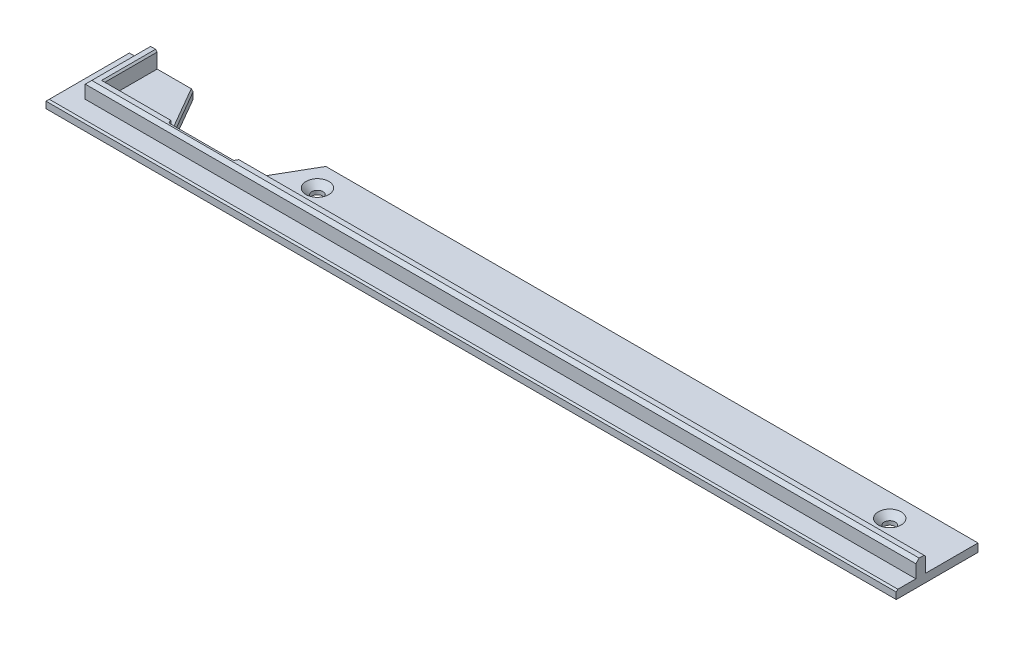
ISO-10303-21;
HEADER;
FILE_DESCRIPTION(('STEP AP214'),'2;1');
FILE_NAME('part.step','',(''),(''),'','','');
FILE_SCHEMA(('AUTOMOTIVE_DESIGN { 1 0 10303 214 1 1 1 1 }'));
ENDSEC;
DATA;
#1=APPLICATION_CONTEXT('core data for automotive mechanical design processes');
#2=APPLICATION_PROTOCOL_DEFINITION('international standard','automotive_design',2000,#1);
#3=PRODUCT_CONTEXT('',#1,'mechanical');
#4=PRODUCT('Part','Part','',(#3));
#5=PRODUCT_RELATED_PRODUCT_CATEGORY('part','',(#4));
#6=PRODUCT_DEFINITION_FORMATION('','',#4);
#7=PRODUCT_DEFINITION_CONTEXT('part definition',#1,'design');
#8=PRODUCT_DEFINITION('design','',#6,#7);
#9=PRODUCT_DEFINITION_SHAPE('','',#8);
#10=(LENGTH_UNIT() NAMED_UNIT(*) SI_UNIT(.MILLI.,.METRE.));
#11=(NAMED_UNIT(*) PLANE_ANGLE_UNIT() SI_UNIT($,.RADIAN.));
#12=(NAMED_UNIT(*) SI_UNIT($,.STERADIAN.) SOLID_ANGLE_UNIT());
#13=UNCERTAINTY_MEASURE_WITH_UNIT(LENGTH_MEASURE(1.E-05),#10,'distance_accuracy_value','');
#14=(GEOMETRIC_REPRESENTATION_CONTEXT(3) GLOBAL_UNCERTAINTY_ASSIGNED_CONTEXT((#13)) GLOBAL_UNIT_ASSIGNED_CONTEXT((#10,
#11,#12)) REPRESENTATION_CONTEXT('',''));
#15=CARTESIAN_POINT('',(0.,0.,0.));
#16=DIRECTION('',(0.,0.,1.));
#17=DIRECTION('',(1.,0.,0.));
#18=AXIS2_PLACEMENT_3D('',#15,#16,#17);
#19=CARTESIAN_POINT('',(0.,3.,0.));
#20=DIRECTION('',(0.,-1.,0.));
#21=DIRECTION('',(0.,0.,-1.));
#22=AXIS2_PLACEMENT_3D('',#19,#20,#21);
#23=PLANE('',#22);
#24=CARTESIAN_POINT('',(-65.,3.,-5.5));
#25=DIRECTION('',(0.,1.,0.));
#26=DIRECTION('',(0.,0.,1.));
#27=AXIS2_PLACEMENT_3D('',#24,#25,#26);
#28=CIRCLE('',#27,3.5);
#29=CARTESIAN_POINT('',(-65.,3.,-1.99999999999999));
#30=VERTEX_POINT('',#29);
#31=EDGE_CURVE('E270',#30,#30,#28,.T.);
#32=ORIENTED_EDGE('',*,*,#31,.F.);
#33=EDGE_LOOP('',(#32));
#34=FACE_BOUND('',#33,.T.);
#35=CARTESIAN_POINT('',(110.,3.,-5.5));
#36=DIRECTION('',(0.,1.,0.));
#37=DIRECTION('',(0.,0.,1.));
#38=AXIS2_PLACEMENT_3D('',#35,#36,#37);
#39=CIRCLE('',#38,3.5);
#40=CARTESIAN_POINT('',(110.,3.,-1.99999999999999));
#41=VERTEX_POINT('',#40);
#42=EDGE_CURVE('E261',#41,#41,#39,.T.);
#43=ORIENTED_EDGE('',*,*,#42,.F.);
#44=EDGE_LOOP('',(#43));
#45=FACE_BOUND('',#44,.T.);
#46=DIRECTION('',(-1.,0.,0.));
#47=VECTOR('',#46,1.);
#48=CARTESIAN_POINT('',(-130.,3.,-12.5));
#49=LINE('',#48,#47);
#50=CARTESIAN_POINT('',(130.,3.,-12.5));
#51=VERTEX_POINT('',#50);
#52=CARTESIAN_POINT('',(-69.4226497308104,3.,-12.5));
#53=VERTEX_POINT('',#52);
#54=EDGE_CURVE('E318',#51,#53,#49,.T.);
#55=ORIENTED_EDGE('',*,*,#54,.T.);
#56=DIRECTION('',(-0.500000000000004,0.,0.866025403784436));
#57=VECTOR('',#56,1.);
#58=CARTESIAN_POINT('',(-57.4796460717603,3.,-33.1858891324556));
#59=LINE('',#58,#57);
#60=CARTESIAN_POINT('',(-78.6602540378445,3.,3.5));
#61=VERTEX_POINT('',#60);
#62=EDGE_CURVE('E426',#53,#61,#59,.T.);
#63=ORIENTED_EDGE('',*,*,#62,.T.);
#64=DIRECTION('',(-1.,0.,0.));
#65=VECTOR('',#64,1.);
#66=CARTESIAN_POINT('',(-121.,3.,3.5));
#67=LINE('',#66,#65);
#68=CARTESIAN_POINT('',(130.,3.,3.5));
#69=VERTEX_POINT('',#68);
#70=EDGE_CURVE('E284',#69,#61,#67,.T.);
#71=ORIENTED_EDGE('',*,*,#70,.F.);
#72=DIRECTION('',(0.,0.,-1.));
#73=VECTOR('',#72,1.);
#74=CARTESIAN_POINT('',(130.,3.,12.5));
#75=LINE('',#74,#73);
#76=EDGE_CURVE('E313',#69,#51,#75,.T.);
#77=ORIENTED_EDGE('',*,*,#76,.T.);
#78=EDGE_LOOP('',(#55,#63,#71,#77));
#79=FACE_BOUND('',#78,.T.);
#80=ADVANCED_FACE('F36',(#34,#45,#79),#23,.F.);
#81=CARTESIAN_POINT('',(-130.,3.,-12.5));
#82=DIRECTION('',(0.,0.,1.));
#83=DIRECTION('',(1.,0.,0.));
#84=AXIS2_PLACEMENT_3D('',#81,#82,#83);
#85=PLANE('',#84);
#86=DIRECTION('',(0.,1.,0.));
#87=VECTOR('',#86,1.);
#88=CARTESIAN_POINT('',(-70.,0.,-12.5));
#89=LINE('',#88,#87);
#90=CARTESIAN_POINT('',(-70.,0.500000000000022,-12.5));
#91=VERTEX_POINT('',#90);
#92=CARTESIAN_POINT('',(-70.,2.50000000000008,-12.5));
#93=VERTEX_POINT('',#92);
#94=EDGE_CURVE('E251',#91,#93,#89,.T.);
#95=ORIENTED_EDGE('',*,*,#94,.T.);
#96=DIRECTION('',(-0.755928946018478,-0.65465367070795,0.));
#97=VECTOR('',#96,1.);
#98=CARTESIAN_POINT('',(-62.5980762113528,8.91025403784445,-12.5));
#99=LINE('',#98,#97);
#100=EDGE_CURVE('E433',#93,#53,#99,.F.);
#101=ORIENTED_EDGE('',*,*,#100,.T.);
#102=ORIENTED_EDGE('',*,*,#54,.F.);
#103=DIRECTION('',(0.,-1.,0.));
#104=VECTOR('',#103,1.);
#105=CARTESIAN_POINT('',(130.,3.,-12.5));
#106=LINE('',#105,#104);
#107=CARTESIAN_POINT('',(130.,0.500000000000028,-12.5));
#108=VERTEX_POINT('',#107);
#109=EDGE_CURVE('E331',#51,#108,#106,.T.);
#110=ORIENTED_EDGE('',*,*,#109,.T.);
#111=DIRECTION('',(-1.,0.,0.));
#112=VECTOR('',#111,1.);
#113=CARTESIAN_POINT('',(-130.,0.500000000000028,-12.5));
#114=LINE('',#113,#112);
#115=EDGE_CURVE('E339',#108,#91,#114,.T.);
#116=ORIENTED_EDGE('',*,*,#115,.T.);
#117=EDGE_LOOP('',(#95,#101,#102,#110,#116));
#118=FACE_BOUND('',#117,.T.);
#119=ADVANCED_FACE('F541',(#118),#85,.F.);
#120=CARTESIAN_POINT('',(-121.,8.,3.5));
#121=DIRECTION('',(0.,0.,1.));
#122=DIRECTION('',(1.,0.,0.));
#123=AXIS2_PLACEMENT_3D('',#120,#121,#122);
#124=PLANE('',#123);
#125=ORIENTED_EDGE('',*,*,#70,.T.);
#126=DIRECTION('',(0.755928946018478,0.65465367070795,0.));
#127=VECTOR('',#126,1.);
#128=CARTESIAN_POINT('',(-100.380036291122,-15.8098831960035,3.5));
#129=LINE('',#128,#127);
#130=CARTESIAN_POINT('',(-79.2376043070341,2.50000000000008,3.5));
#131=VERTEX_POINT('',#130);
#132=EDGE_CURVE('E11',#61,#131,#129,.F.);
#133=ORIENTED_EDGE('',*,*,#132,.T.);
#134=DIRECTION('',(0.,1.,0.));
#135=VECTOR('',#134,1.);
#136=CARTESIAN_POINT('',(-79.2376043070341,8.,3.5));
#137=LINE('',#136,#135);
#138=CARTESIAN_POINT('',(-79.2376043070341,7.49999999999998,3.5));
#139=VERTEX_POINT('',#138);
#140=EDGE_CURVE('E258',#131,#139,#137,.T.);
#141=ORIENTED_EDGE('',*,*,#140,.T.);
#142=DIRECTION('',(1.,0.,0.));
#143=VECTOR('',#142,1.);
#144=CARTESIAN_POINT('',(130.,7.49999999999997,3.5));
#145=LINE('',#144,#143);
#146=CARTESIAN_POINT('',(130.,7.49999999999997,3.5));
#147=VERTEX_POINT('',#146);
#148=EDGE_CURVE('E379',#139,#147,#145,.T.);
#149=ORIENTED_EDGE('',*,*,#148,.T.);
#150=DIRECTION('',(0.,-1.,0.));
#151=VECTOR('',#150,1.);
#152=CARTESIAN_POINT('',(130.,8.,3.5));
#153=LINE('',#152,#151);
#154=EDGE_CURVE('E302',#147,#69,#153,.T.);
#155=ORIENTED_EDGE('',*,*,#154,.T.);
#156=EDGE_LOOP('',(#125,#133,#141,#149,#155));
#157=FACE_BOUND('',#156,.T.);
#158=ADVANCED_FACE('F547',(#157),#124,.F.);
#159=CARTESIAN_POINT('',(-130.,0.500000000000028,-12.5));
#160=DIRECTION('',(0.,-0.707106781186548,-0.707106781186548));
#161=DIRECTION('',(1.,0.,0.));
#162=AXIS2_PLACEMENT_3D('',#159,#160,#161);
#163=PLANE('',#162);
#164=DIRECTION('',(1.,0.,0.));
#165=VECTOR('',#164,1.);
#166=CARTESIAN_POINT('',(130.,0.,-12.));
#167=LINE('',#166,#165);
#168=CARTESIAN_POINT('',(-69.7113248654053,0.,-12.));
#169=VERTEX_POINT('',#168);
#170=CARTESIAN_POINT('',(129.5,0.,-12.));
#171=VERTEX_POINT('',#170);
#172=EDGE_CURVE('E348',#169,#171,#167,.T.);
#173=ORIENTED_EDGE('',*,*,#172,.F.);
#174=DIRECTION('',(-0.377964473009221,0.654653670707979,-0.654653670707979));
#175=VECTOR('',#174,1.);
#176=CARTESIAN_POINT('',(-78.5714285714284,15.3461497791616,-27.3461497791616));
#177=LINE('',#176,#175);
#178=EDGE_CURVE('E439',#169,#91,#177,.T.);
#179=ORIENTED_EDGE('',*,*,#178,.T.);
#180=ORIENTED_EDGE('',*,*,#115,.F.);
#181=DIRECTION('',(0.577350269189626,0.577350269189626,-0.577350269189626));
#182=VECTOR('',#181,1.);
#183=CARTESIAN_POINT('',(121.666666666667,-7.8333333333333,-4.16666666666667));
#184=LINE('',#183,#182);
#185=EDGE_CURVE('E387',#108,#171,#184,.F.);
#186=ORIENTED_EDGE('',*,*,#185,.T.);
#187=EDGE_LOOP('',(#173,#179,#180,#186));
#188=FACE_BOUND('',#187,.T.);
#189=ADVANCED_FACE('F559',(#188),#163,.T.);
#190=CARTESIAN_POINT('',(0.,8.,4.00000000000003));
#191=DIRECTION('',(0.,0.707106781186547,-0.707106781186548));
#192=DIRECTION('',(1.,0.,0.));
#193=AXIS2_PLACEMENT_3D('',#190,#191,#192);
#194=PLANE('',#193);
#195=DIRECTION('',(0.37796447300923,-0.654653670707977,-0.654653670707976));
#196=VECTOR('',#195,1.);
#197=CARTESIAN_POINT('',(-68.1653823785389,-11.6776509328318,-15.6776509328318));
#198=LINE('',#197,#196);
#199=CARTESIAN_POINT('',(-79.5262794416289,8.,4.00000000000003));
#200=VERTEX_POINT('',#199);
#201=EDGE_CURVE('E414',#200,#139,#198,.T.);
#202=ORIENTED_EDGE('',*,*,#201,.F.);
#203=DIRECTION('',(-1.,0.,0.));
#204=VECTOR('',#203,1.);
#205=CARTESIAN_POINT('',(-121.,8.,4.00000000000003));
#206=LINE('',#205,#204);
#207=CARTESIAN_POINT('',(130.,8.,4.00000000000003));
#208=VERTEX_POINT('',#207);
#209=EDGE_CURVE('E372',#208,#200,#206,.T.);
#210=ORIENTED_EDGE('',*,*,#209,.F.);
#211=DIRECTION('',(0.,0.707106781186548,0.707106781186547));
#212=VECTOR('',#211,1.);
#213=CARTESIAN_POINT('',(130.,8.,4.00000000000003));
#214=LINE('',#213,#212);
#215=EDGE_CURVE('E359',#147,#208,#214,.T.);
#216=ORIENTED_EDGE('',*,*,#215,.F.);
#217=ORIENTED_EDGE('',*,*,#148,.F.);
#218=EDGE_LOOP('',(#202,#210,#216,#217));
#219=FACE_BOUND('',#218,.T.);
#220=ADVANCED_FACE('F555',(#219),#194,.T.);
#221=CARTESIAN_POINT('',(-101.339745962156,3.,3.5));
#222=VERTEX_POINT('',#221);
#223=CARTESIAN_POINT('',(-121.,3.,3.5));
#224=VERTEX_POINT('',#223);
#225=EDGE_CURVE('E297',#222,#224,#67,.T.);
#226=ORIENTED_EDGE('',*,*,#225,.F.);
#227=DIRECTION('',(-0.500000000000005,0.,-0.866025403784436));
#228=VECTOR('',#227,1.);
#229=CARTESIAN_POINT('',(-77.520353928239,3.,44.7563972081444));
#230=LINE('',#229,#228);
#231=CARTESIAN_POINT('',(-110.57735026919,3.,-12.5));
#232=VERTEX_POINT('',#231);
#233=EDGE_CURVE('E416',#222,#232,#230,.T.);
#234=ORIENTED_EDGE('',*,*,#233,.T.);
#235=CARTESIAN_POINT('',(-121.,3.,-12.5));
#236=VERTEX_POINT('',#235);
#237=EDGE_CURVE('E322',#232,#236,#49,.T.);
#238=ORIENTED_EDGE('',*,*,#237,.T.);
#239=DIRECTION('',(0.,0.,-1.));
#240=VECTOR('',#239,1.);
#241=CARTESIAN_POINT('',(-121.,3.,-12.5));
#242=LINE('',#241,#240);
#243=EDGE_CURVE('E287',#224,#236,#242,.T.);
#244=ORIENTED_EDGE('',*,*,#243,.F.);
#245=EDGE_LOOP('',(#226,#234,#238,#244));
#246=FACE_BOUND('',#245,.T.);
#247=ADVANCED_FACE('F491',(#246),#23,.F.);
#248=CARTESIAN_POINT('',(-124.,3.,-12.5));
#249=VERTEX_POINT('',#248);
#250=CARTESIAN_POINT('',(-129.5,3.,-12.5));
#251=VERTEX_POINT('',#250);
#252=EDGE_CURVE('E317',#249,#251,#49,.T.);
#253=ORIENTED_EDGE('',*,*,#252,.T.);
#254=DIRECTION('',(0.,0.,1.));
#255=VECTOR('',#254,1.);
#256=CARTESIAN_POINT('',(-129.5,3.,0.));
#257=LINE('',#256,#255);
#258=CARTESIAN_POINT('',(-129.5,3.,12.));
#259=VERTEX_POINT('',#258);
#260=EDGE_CURVE('E368',#251,#259,#257,.T.);
#261=ORIENTED_EDGE('',*,*,#260,.T.);
#262=DIRECTION('',(1.,0.,0.));
#263=VECTOR('',#262,1.);
#264=CARTESIAN_POINT('',(0.,3.,12.));
#265=LINE('',#264,#263);
#266=CARTESIAN_POINT('',(130.,3.,12.));
#267=VERTEX_POINT('',#266);
#268=EDGE_CURVE('E366',#259,#267,#265,.T.);
#269=ORIENTED_EDGE('',*,*,#268,.T.);
#270=CARTESIAN_POINT('',(130.,3.,6.5));
#271=VERTEX_POINT('',#270);
#272=EDGE_CURVE('E314',#267,#271,#75,.T.);
#273=ORIENTED_EDGE('',*,*,#272,.T.);
#274=DIRECTION('',(1.,0.,0.));
#275=VECTOR('',#274,1.);
#276=CARTESIAN_POINT('',(-124.,3.,6.5));
#277=LINE('',#276,#275);
#278=CARTESIAN_POINT('',(-124.,3.,6.5));
#279=VERTEX_POINT('',#278);
#280=EDGE_CURVE('E294',#279,#271,#277,.T.);
#281=ORIENTED_EDGE('',*,*,#280,.F.);
#282=DIRECTION('',(0.,0.,1.));
#283=VECTOR('',#282,1.);
#284=CARTESIAN_POINT('',(-124.,3.,6.5));
#285=LINE('',#284,#283);
#286=EDGE_CURVE('E290',#249,#279,#285,.T.);
#287=ORIENTED_EDGE('',*,*,#286,.F.);
#288=EDGE_LOOP('',(#253,#261,#269,#273,#281,#287));
#289=FACE_BOUND('',#288,.T.);
#290=ADVANCED_FACE('F483',(#289),#23,.F.);
#291=CARTESIAN_POINT('',(130.,3.,12.5));
#292=DIRECTION('',(-1.,0.,0.));
#293=DIRECTION('',(0.,0.,1.));
#294=AXIS2_PLACEMENT_3D('',#291,#292,#293);
#295=PLANE('',#294);
#296=DIRECTION('',(0.,0.,-1.));
#297=VECTOR('',#296,1.);
#298=CARTESIAN_POINT('',(130.,8.,3.5));
#299=LINE('',#298,#297);
#300=CARTESIAN_POINT('',(130.,8.,5.5));
#301=VERTEX_POINT('',#300);
#302=EDGE_CURVE('E283',#301,#208,#299,.T.);
#303=ORIENTED_EDGE('',*,*,#302,.F.);
#304=DIRECTION('',(0.,-0.707106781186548,0.707106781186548));
#305=VECTOR('',#304,1.);
#306=CARTESIAN_POINT('',(130.,8.,5.5));
#307=LINE('',#306,#305);
#308=CARTESIAN_POINT('',(130.,7.,6.5));
#309=VERTEX_POINT('',#308);
#310=EDGE_CURVE('E408',#301,#309,#307,.T.);
#311=ORIENTED_EDGE('',*,*,#310,.T.);
#312=DIRECTION('',(0.,-1.,0.));
#313=VECTOR('',#312,1.);
#314=CARTESIAN_POINT('',(130.,8.,6.5));
#315=LINE('',#314,#313);
#316=EDGE_CURVE('E304',#309,#271,#315,.T.);
#317=ORIENTED_EDGE('',*,*,#316,.T.);
#318=ORIENTED_EDGE('',*,*,#272,.F.);
#319=DIRECTION('',(0.,0.707106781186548,-0.707106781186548));
#320=VECTOR('',#319,1.);
#321=CARTESIAN_POINT('',(130.,3.,12.));
#322=LINE('',#321,#320);
#323=CARTESIAN_POINT('',(130.,2.49999999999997,12.5));
#324=VERTEX_POINT('',#323);
#325=EDGE_CURVE('E362',#267,#324,#322,.F.);
#326=ORIENTED_EDGE('',*,*,#325,.T.);
#327=DIRECTION('',(0.,-1.,0.));
#328=VECTOR('',#327,1.);
#329=CARTESIAN_POINT('',(130.,3.,12.5));
#330=LINE('',#329,#328);
#331=CARTESIAN_POINT('',(130.,0.500000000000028,12.5));
#332=VERTEX_POINT('',#331);
#333=EDGE_CURVE('E321',#324,#332,#330,.T.);
#334=ORIENTED_EDGE('',*,*,#333,.T.);
#335=DIRECTION('',(0.,0.,-1.));
#336=VECTOR('',#335,1.);
#337=CARTESIAN_POINT('',(130.,0.500000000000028,-12.5));
#338=LINE('',#337,#336);
#339=EDGE_CURVE('E364',#332,#108,#338,.T.);
#340=ORIENTED_EDGE('',*,*,#339,.T.);
#341=ORIENTED_EDGE('',*,*,#109,.F.);
#342=ORIENTED_EDGE('',*,*,#76,.F.);
#343=ORIENTED_EDGE('',*,*,#154,.F.);
#344=ORIENTED_EDGE('',*,*,#215,.T.);
#345=EDGE_LOOP('',(#303,#311,#317,#318,#326,#334,#340,#341,#342,#343,#344));
#346=FACE_BOUND('',#345,.T.);
#347=ADVANCED_FACE('F519',(#346),#295,.F.);
#348=ORIENTED_EDGE('',*,*,#237,.F.);
#349=DIRECTION('',(-0.755928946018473,0.654653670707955,0.));
#350=VECTOR('',#349,1.);
#351=CARTESIAN_POINT('',(-91.6876380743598,-13.3589706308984,-12.5));
#352=LINE('',#351,#350);
#353=CARTESIAN_POINT('',(-110.,2.5,-12.5));
#354=VERTEX_POINT('',#353);
#355=EDGE_CURVE('E419',#232,#354,#352,.F.);
#356=ORIENTED_EDGE('',*,*,#355,.T.);
#357=DIRECTION('',(0.,1.,0.));
#358=VECTOR('',#357,1.);
#359=CARTESIAN_POINT('',(-110.,0.,-12.5));
#360=LINE('',#359,#358);
#361=CARTESIAN_POINT('',(-110.,0.500000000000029,-12.5));
#362=VERTEX_POINT('',#361);
#363=EDGE_CURVE('E234',#362,#354,#360,.T.);
#364=ORIENTED_EDGE('',*,*,#363,.F.);
#365=CARTESIAN_POINT('',(-130.,0.500000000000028,-12.5));
#366=VERTEX_POINT('',#365);
#367=EDGE_CURVE('E338',#362,#366,#114,.T.);
#368=ORIENTED_EDGE('',*,*,#367,.T.);
#369=DIRECTION('',(0.,-1.,0.));
#370=VECTOR('',#369,1.);
#371=CARTESIAN_POINT('',(-130.,3.,-12.5));
#372=LINE('',#371,#370);
#373=CARTESIAN_POINT('',(-130.,2.49999999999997,-12.5));
#374=VERTEX_POINT('',#373);
#375=EDGE_CURVE('E328',#374,#366,#372,.T.);
#376=ORIENTED_EDGE('',*,*,#375,.F.);
#377=DIRECTION('',(-0.707106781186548,-0.707106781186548,0.));
#378=VECTOR('',#377,1.);
#379=CARTESIAN_POINT('',(-129.5,3.,-12.5));
#380=LINE('',#379,#378);
#381=EDGE_CURVE('E336',#374,#251,#380,.F.);
#382=ORIENTED_EDGE('',*,*,#381,.T.);
#383=ORIENTED_EDGE('',*,*,#252,.F.);
#384=DIRECTION('',(0.,-1.,0.));
#385=VECTOR('',#384,1.);
#386=CARTESIAN_POINT('',(-124.,8.,-12.5));
#387=LINE('',#386,#385);
#388=CARTESIAN_POINT('',(-124.,7.,-12.5));
#389=VERTEX_POINT('',#388);
#390=EDGE_CURVE('E308',#389,#249,#387,.T.);
#391=ORIENTED_EDGE('',*,*,#390,.F.);
#392=DIRECTION('',(0.707106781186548,0.707106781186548,0.));
#393=VECTOR('',#392,1.);
#394=CARTESIAN_POINT('',(-123.,8.,-12.5));
#395=LINE('',#394,#393);
#396=CARTESIAN_POINT('',(-123.,8.,-12.5));
#397=VERTEX_POINT('',#396);
#398=EDGE_CURVE('E406',#389,#397,#395,.T.);
#399=ORIENTED_EDGE('',*,*,#398,.T.);
#400=DIRECTION('',(-1.,0.,0.));
#401=VECTOR('',#400,1.);
#402=CARTESIAN_POINT('',(-124.,8.,-12.5));
#403=LINE('',#402,#401);
#404=CARTESIAN_POINT('',(-121.5,8.,-12.5));
#405=VERTEX_POINT('',#404);
#406=EDGE_CURVE('E280',#405,#397,#403,.T.);
#407=ORIENTED_EDGE('',*,*,#406,.F.);
#408=DIRECTION('',(0.707106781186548,-0.707106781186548,0.));
#409=VECTOR('',#408,1.);
#410=CARTESIAN_POINT('',(-121.5,8.,-12.5));
#411=LINE('',#410,#409);
#412=CARTESIAN_POINT('',(-121.,7.49999999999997,-12.5));
#413=VERTEX_POINT('',#412);
#414=EDGE_CURVE('E334',#405,#413,#411,.T.);
#415=ORIENTED_EDGE('',*,*,#414,.T.);
#416=DIRECTION('',(0.,-1.,0.));
#417=VECTOR('',#416,1.);
#418=CARTESIAN_POINT('',(-121.,8.,-12.5));
#419=LINE('',#418,#417);
#420=EDGE_CURVE('E310',#413,#236,#419,.T.);
#421=ORIENTED_EDGE('',*,*,#420,.T.);
#422=EDGE_LOOP('',(#348,#356,#364,#368,#376,#382,#383,#391,#399,#407,#415,#421));
#423=FACE_BOUND('',#422,.T.);
#424=ADVANCED_FACE('F459',(#423),#85,.F.);
#425=CARTESIAN_POINT('',(-130.,3.,12.5));
#426=DIRECTION('',(1.,0.,0.));
#427=DIRECTION('',(0.,0.,-1.));
#428=AXIS2_PLACEMENT_3D('',#425,#426,#427);
#429=PLANE('',#428);
#430=ORIENTED_EDGE('',*,*,#375,.T.);
#431=DIRECTION('',(0.,0.,1.));
#432=VECTOR('',#431,1.);
#433=CARTESIAN_POINT('',(-130.,0.500000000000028,12.5));
#434=LINE('',#433,#432);
#435=CARTESIAN_POINT('',(-130.,0.500000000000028,12.5));
#436=VERTEX_POINT('',#435);
#437=EDGE_CURVE('E353',#366,#436,#434,.T.);
#438=ORIENTED_EDGE('',*,*,#437,.T.);
#439=DIRECTION('',(0.,-1.,0.));
#440=VECTOR('',#439,1.);
#441=CARTESIAN_POINT('',(-130.,3.,12.5));
#442=LINE('',#441,#440);
#443=CARTESIAN_POINT('',(-130.,2.49999999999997,12.5));
#444=VERTEX_POINT('',#443);
#445=EDGE_CURVE('E325',#444,#436,#442,.T.);
#446=ORIENTED_EDGE('',*,*,#445,.F.);
#447=DIRECTION('',(0.,0.,-1.));
#448=VECTOR('',#447,1.);
#449=CARTESIAN_POINT('',(-130.,2.49999999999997,12.5));
#450=LINE('',#449,#448);
#451=EDGE_CURVE('E351',#444,#374,#450,.T.);
#452=ORIENTED_EDGE('',*,*,#451,.T.);
#453=EDGE_LOOP('',(#430,#438,#446,#452));
#454=FACE_BOUND('',#453,.T.);
#455=ADVANCED_FACE('F472',(#454),#429,.F.);
#456=CARTESIAN_POINT('',(-130.,3.,12.5));
#457=DIRECTION('',(0.,0.,-1.));
#458=DIRECTION('',(-1.,0.,0.));
#459=AXIS2_PLACEMENT_3D('',#456,#457,#458);
#460=PLANE('',#459);
#461=ORIENTED_EDGE('',*,*,#445,.T.);
#462=DIRECTION('',(1.,0.,0.));
#463=VECTOR('',#462,1.);
#464=CARTESIAN_POINT('',(130.,0.500000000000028,12.5));
#465=LINE('',#464,#463);
#466=EDGE_CURVE('E357',#436,#332,#465,.T.);
#467=ORIENTED_EDGE('',*,*,#466,.T.);
#468=ORIENTED_EDGE('',*,*,#333,.F.);
#469=DIRECTION('',(-1.,0.,0.));
#470=VECTOR('',#469,1.);
#471=CARTESIAN_POINT('',(-130.,2.49999999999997,12.5));
#472=LINE('',#471,#470);
#473=EDGE_CURVE('E355',#324,#444,#472,.T.);
#474=ORIENTED_EDGE('',*,*,#473,.T.);
#475=EDGE_LOOP('',(#461,#467,#468,#474));
#476=FACE_BOUND('',#475,.T.);
#477=ADVANCED_FACE('F784',(#476),#460,.F.);
#478=CARTESIAN_POINT('',(0.,0.,0.));
#479=DIRECTION('',(0.,-1.,0.));
#480=DIRECTION('',(0.,0.,-1.));
#481=AXIS2_PLACEMENT_3D('',#478,#479,#480);
#482=PLANE('',#481);
#483=DIRECTION('',(1.,0.,0.));
#484=VECTOR('',#483,1.);
#485=CARTESIAN_POINT('',(-80.1036297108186,0.,5.49999999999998));
#486=LINE('',#485,#484);
#487=CARTESIAN_POINT('',(-100.185045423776,0.,5.49999999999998));
#488=VERTEX_POINT('',#487);
#489=CARTESIAN_POINT('',(-79.8149545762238,0.,5.49999999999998));
#490=VERTEX_POINT('',#489);
#491=EDGE_CURVE('E54',#488,#490,#486,.T.);
#492=ORIENTED_EDGE('',*,*,#491,.T.);
#493=DIRECTION('',(0.500000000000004,0.,-0.866025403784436));
#494=VECTOR('',#493,1.);
#495=CARTESIAN_POINT('',(-69.8556624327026,0.,-11.75));
#496=LINE('',#495,#494);
#497=EDGE_CURVE('E437',#490,#169,#496,.T.);
#498=ORIENTED_EDGE('',*,*,#497,.T.);
#499=ORIENTED_EDGE('',*,*,#172,.T.);
#500=DIRECTION('',(0.,0.,1.));
#501=VECTOR('',#500,1.);
#502=CARTESIAN_POINT('',(129.5,0.,12.5));
#503=LINE('',#502,#501);
#504=CARTESIAN_POINT('',(129.5,0.,12.));
#505=VERTEX_POINT('',#504);
#506=EDGE_CURVE('E342',#171,#505,#503,.T.);
#507=ORIENTED_EDGE('',*,*,#506,.T.);
#508=DIRECTION('',(-1.,0.,0.));
#509=VECTOR('',#508,1.);
#510=CARTESIAN_POINT('',(-130.,0.,12.));
#511=LINE('',#510,#509);
#512=CARTESIAN_POINT('',(-129.5,0.,12.));
#513=VERTEX_POINT('',#512);
#514=EDGE_CURVE('E344',#505,#513,#511,.T.);
#515=ORIENTED_EDGE('',*,*,#514,.T.);
#516=DIRECTION('',(0.,0.,-1.));
#517=VECTOR('',#516,1.);
#518=CARTESIAN_POINT('',(-129.5,0.,-12.5));
#519=LINE('',#518,#517);
#520=CARTESIAN_POINT('',(-129.5,0.,-12.));
#521=VERTEX_POINT('',#520);
#522=EDGE_CURVE('E346',#513,#521,#519,.T.);
#523=ORIENTED_EDGE('',*,*,#522,.T.);
#524=CARTESIAN_POINT('',(-110.288675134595,0.,-12.));
#525=VERTEX_POINT('',#524);
#526=EDGE_CURVE('E349',#521,#525,#167,.T.);
#527=ORIENTED_EDGE('',*,*,#526,.T.);
#528=DIRECTION('',(0.500000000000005,0.,0.866025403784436));
#529=VECTOR('',#528,1.);
#530=CARTESIAN_POINT('',(-100.329382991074,0.,5.25));
#531=LINE('',#530,#529);
#532=EDGE_CURVE('E59',#525,#488,#531,.T.);
#533=ORIENTED_EDGE('',*,*,#532,.T.);
#534=EDGE_LOOP('',(#492,#498,#499,#507,#515,#523,#527,#533));
#535=FACE_BOUND('',#534,.T.);
#536=CARTESIAN_POINT('',(110.,0.,-5.5));
#537=DIRECTION('',(0.,1.,0.));
#538=DIRECTION('',(0.,0.,1.));
#539=AXIS2_PLACEMENT_3D('',#536,#537,#538);
#540=CIRCLE('',#539,1.69999999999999);
#541=CARTESIAN_POINT('',(110.,0.,-3.8));
#542=VERTEX_POINT('',#541);
#543=EDGE_CURVE('E267',#542,#542,#540,.T.);
#544=ORIENTED_EDGE('',*,*,#543,.T.);
#545=EDGE_LOOP('',(#544));
#546=FACE_BOUND('',#545,.T.);
#547=CARTESIAN_POINT('',(-65.,0.,-5.5));
#548=DIRECTION('',(0.,1.,0.));
#549=DIRECTION('',(0.,0.,1.));
#550=AXIS2_PLACEMENT_3D('',#547,#548,#549);
#551=CIRCLE('',#550,1.69999999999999);
#552=CARTESIAN_POINT('',(-65.,0.,-3.8));
#553=VERTEX_POINT('',#552);
#554=EDGE_CURVE('E276',#553,#553,#551,.T.);
#555=ORIENTED_EDGE('',*,*,#554,.T.);
#556=EDGE_LOOP('',(#555));
#557=FACE_BOUND('',#556,.T.);
#558=ADVANCED_FACE('F538',(#535,#546,#557),#482,.T.);
#559=CARTESIAN_POINT('',(-121.,8.,-12.5));
#560=DIRECTION('',(-1.,0.,0.));
#561=DIRECTION('',(0.,0.,1.));
#562=AXIS2_PLACEMENT_3D('',#559,#560,#561);
#563=PLANE('',#562);
#564=ORIENTED_EDGE('',*,*,#420,.F.);
#565=DIRECTION('',(0.,0.,1.));
#566=VECTOR('',#565,1.);
#567=CARTESIAN_POINT('',(-121.,7.49999999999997,3.5));
#568=LINE('',#567,#566);
#569=CARTESIAN_POINT('',(-121.,7.49999999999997,3.5));
#570=VERTEX_POINT('',#569);
#571=EDGE_CURVE('E377',#413,#570,#568,.T.);
#572=ORIENTED_EDGE('',*,*,#571,.T.);
#573=DIRECTION('',(0.,-1.,0.));
#574=VECTOR('',#573,1.);
#575=CARTESIAN_POINT('',(-121.,8.,3.5));
#576=LINE('',#575,#574);
#577=EDGE_CURVE('E286',#570,#224,#576,.T.);
#578=ORIENTED_EDGE('',*,*,#577,.T.);
#579=ORIENTED_EDGE('',*,*,#243,.T.);
#580=EDGE_LOOP('',(#564,#572,#578,#579));
#581=FACE_BOUND('',#580,.T.);
#582=ADVANCED_FACE('F497',(#581),#563,.F.);
#583=CARTESIAN_POINT('',(-124.,8.,6.5));
#584=DIRECTION('',(1.,0.,0.));
#585=DIRECTION('',(0.,0.,-1.));
#586=AXIS2_PLACEMENT_3D('',#583,#584,#585);
#587=PLANE('',#586);
#588=DIRECTION('',(0.,-1.,0.));
#589=VECTOR('',#588,1.);
#590=CARTESIAN_POINT('',(-124.,8.,6.5));
#591=LINE('',#590,#589);
#592=CARTESIAN_POINT('',(-124.,7.,6.5));
#593=VERTEX_POINT('',#592);
#594=EDGE_CURVE('E306',#593,#279,#591,.T.);
#595=ORIENTED_EDGE('',*,*,#594,.F.);
#596=DIRECTION('',(0.,0.,-1.));
#597=VECTOR('',#596,1.);
#598=CARTESIAN_POINT('',(-124.,7.,-12.5));
#599=LINE('',#598,#597);
#600=EDGE_CURVE('E404',#593,#389,#599,.T.);
#601=ORIENTED_EDGE('',*,*,#600,.T.);
#602=ORIENTED_EDGE('',*,*,#390,.T.);
#603=ORIENTED_EDGE('',*,*,#286,.T.);
#604=EDGE_LOOP('',(#595,#601,#602,#603));
#605=FACE_BOUND('',#604,.T.);
#606=ADVANCED_FACE('F530',(#605),#587,.F.);
#607=CARTESIAN_POINT('',(-124.,8.,6.5));
#608=DIRECTION('',(0.,0.,-1.));
#609=DIRECTION('',(-1.,0.,0.));
#610=AXIS2_PLACEMENT_3D('',#607,#608,#609);
#611=PLANE('',#610);
#612=ORIENTED_EDGE('',*,*,#316,.F.);
#613=DIRECTION('',(-1.,0.,0.));
#614=VECTOR('',#613,1.);
#615=CARTESIAN_POINT('',(-124.,7.,6.5));
#616=LINE('',#615,#614);
#617=EDGE_CURVE('E410',#309,#593,#616,.T.);
#618=ORIENTED_EDGE('',*,*,#617,.T.);
#619=ORIENTED_EDGE('',*,*,#594,.T.);
#620=ORIENTED_EDGE('',*,*,#280,.T.);
#621=EDGE_LOOP('',(#612,#618,#619,#620));
#622=FACE_BOUND('',#621,.T.);
#623=ADVANCED_FACE('F528',(#622),#611,.F.);
#624=CARTESIAN_POINT('',(-100.762395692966,7.49999999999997,3.5));
#625=VERTEX_POINT('',#624);
#626=EDGE_CURVE('E380',#570,#625,#145,.T.);
#627=ORIENTED_EDGE('',*,*,#626,.T.);
#628=DIRECTION('',(0.,-1.,0.));
#629=VECTOR('',#628,1.);
#630=CARTESIAN_POINT('',(-100.762395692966,8.,3.5));
#631=LINE('',#630,#629);
#632=CARTESIAN_POINT('',(-100.762395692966,2.5,3.5));
#633=VERTEX_POINT('',#632);
#634=EDGE_CURVE('E254',#625,#633,#631,.T.);
#635=ORIENTED_EDGE('',*,*,#634,.T.);
#636=DIRECTION('',(0.755928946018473,-0.654653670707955,0.));
#637=VECTOR('',#636,1.);
#638=CARTESIAN_POINT('',(-115.048535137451,14.8721596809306,3.5));
#639=LINE('',#638,#637);
#640=EDGE_CURVE('E46',#633,#222,#639,.F.);
#641=ORIENTED_EDGE('',*,*,#640,.T.);
#642=ORIENTED_EDGE('',*,*,#225,.T.);
#643=ORIENTED_EDGE('',*,*,#577,.F.);
#644=EDGE_LOOP('',(#627,#635,#641,#642,#643));
#645=FACE_BOUND('',#644,.T.);
#646=ADVANCED_FACE('F501',(#645),#124,.F.);
#647=CARTESIAN_POINT('',(0.,8.,0.));
#648=DIRECTION('',(0.,1.,0.));
#649=DIRECTION('',(0.,0.,1.));
#650=AXIS2_PLACEMENT_3D('',#647,#648,#649);
#651=PLANE('',#650);
#652=DIRECTION('',(0.500000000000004,0.,-0.866025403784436));
#653=VECTOR('',#652,1.);
#654=CARTESIAN_POINT('',(-80.1036297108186,8.,5.));
#655=LINE('',#654,#653);
#656=CARTESIAN_POINT('',(-80.1036297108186,8.,5.));
#657=VERTEX_POINT('',#656);
#658=EDGE_CURVE('E247',#657,#200,#655,.T.);
#659=ORIENTED_EDGE('',*,*,#658,.F.);
#660=DIRECTION('',(1.,0.,0.));
#661=VECTOR('',#660,1.);
#662=CARTESIAN_POINT('',(-99.8963702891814,8.,5.));
#663=LINE('',#662,#661);
#664=CARTESIAN_POINT('',(-99.8963702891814,8.,5.));
#665=VERTEX_POINT('',#664);
#666=EDGE_CURVE('E227',#665,#657,#663,.T.);
#667=ORIENTED_EDGE('',*,*,#666,.F.);
#668=DIRECTION('',(0.500000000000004,0.,0.866025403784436));
#669=VECTOR('',#668,1.);
#670=CARTESIAN_POINT('',(-110.,8.,-12.5));
#671=LINE('',#670,#669);
#672=CARTESIAN_POINT('',(-100.473720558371,8.,4.00000000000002));
#673=VERTEX_POINT('',#672);
#674=EDGE_CURVE('E237',#673,#665,#671,.T.);
#675=ORIENTED_EDGE('',*,*,#674,.F.);
#676=CARTESIAN_POINT('',(-121.5,8.,4.00000000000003));
#677=VERTEX_POINT('',#676);
#678=EDGE_CURVE('E371',#673,#677,#206,.T.);
#679=ORIENTED_EDGE('',*,*,#678,.T.);
#680=DIRECTION('',(0.,0.,-1.));
#681=VECTOR('',#680,1.);
#682=CARTESIAN_POINT('',(-121.5,8.,-12.5));
#683=LINE('',#682,#681);
#684=EDGE_CURVE('E374',#677,#405,#683,.T.);
#685=ORIENTED_EDGE('',*,*,#684,.T.);
#686=ORIENTED_EDGE('',*,*,#406,.T.);
#687=DIRECTION('',(0.,0.,1.));
#688=VECTOR('',#687,1.);
#689=CARTESIAN_POINT('',(-123.,8.,6.5));
#690=LINE('',#689,#688);
#691=CARTESIAN_POINT('',(-123.,8.,5.5));
#692=VERTEX_POINT('',#691);
#693=EDGE_CURVE('E401',#397,#692,#690,.T.);
#694=ORIENTED_EDGE('',*,*,#693,.T.);
#695=DIRECTION('',(1.,0.,0.));
#696=VECTOR('',#695,1.);
#697=CARTESIAN_POINT('',(130.,8.,5.5));
#698=LINE('',#697,#696);
#699=EDGE_CURVE('E383',#692,#301,#698,.T.);
#700=ORIENTED_EDGE('',*,*,#699,.T.);
#701=ORIENTED_EDGE('',*,*,#302,.T.);
#702=ORIENTED_EDGE('',*,*,#209,.T.);
#703=EDGE_LOOP('',(#659,#667,#675,#679,#685,#686,#694,#700,#701,#702));
#704=FACE_BOUND('',#703,.T.);
#705=ADVANCED_FACE('F245',(#704),#651,.T.);
#706=CARTESIAN_POINT('',(-130.,0.500000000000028,12.5));
#707=DIRECTION('',(0.,-0.707106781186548,0.707106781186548));
#708=DIRECTION('',(-1.,0.,0.));
#709=AXIS2_PLACEMENT_3D('',#706,#707,#708);
#710=PLANE('',#709);
#711=DIRECTION('',(0.577350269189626,-0.577350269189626,-0.577350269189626));
#712=VECTOR('',#711,1.);
#713=CARTESIAN_POINT('',(-130.,0.500000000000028,12.5));
#714=LINE('',#713,#712);
#715=EDGE_CURVE('E391',#513,#436,#714,.F.);
#716=ORIENTED_EDGE('',*,*,#715,.F.);
#717=ORIENTED_EDGE('',*,*,#514,.F.);
#718=DIRECTION('',(-0.577350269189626,-0.577350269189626,-0.577350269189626));
#719=VECTOR('',#718,1.);
#720=CARTESIAN_POINT('',(130.,0.500000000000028,12.5));
#721=LINE('',#720,#719);
#722=EDGE_CURVE('E291',#332,#505,#721,.T.);
#723=ORIENTED_EDGE('',*,*,#722,.F.);
#724=ORIENTED_EDGE('',*,*,#466,.F.);
#725=EDGE_LOOP('',(#716,#717,#723,#724));
#726=FACE_BOUND('',#725,.T.);
#727=ADVANCED_FACE('F589',(#726),#710,.T.);
#728=CARTESIAN_POINT('',(130.,0.500000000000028,12.5));
#729=DIRECTION('',(0.707106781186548,-0.707106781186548,0.));
#730=DIRECTION('',(0.,0.,1.));
#731=AXIS2_PLACEMENT_3D('',#728,#729,#730);
#732=PLANE('',#731);
#733=ORIENTED_EDGE('',*,*,#722,.T.);
#734=ORIENTED_EDGE('',*,*,#506,.F.);
#735=ORIENTED_EDGE('',*,*,#185,.F.);
#736=ORIENTED_EDGE('',*,*,#339,.F.);
#737=EDGE_LOOP('',(#733,#734,#735,#736));
#738=FACE_BOUND('',#737,.T.);
#739=ADVANCED_FACE('F655',(#738),#732,.T.);
#740=CARTESIAN_POINT('',(-130.,0.500000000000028,12.5));
#741=DIRECTION('',(-0.707106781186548,-0.707106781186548,0.));
#742=DIRECTION('',(0.,0.,-1.));
#743=AXIS2_PLACEMENT_3D('',#740,#741,#742);
#744=PLANE('',#743);
#745=ORIENTED_EDGE('',*,*,#715,.T.);
#746=ORIENTED_EDGE('',*,*,#437,.F.);
#747=DIRECTION('',(0.577350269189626,-0.577350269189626,0.577350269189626));
#748=VECTOR('',#747,1.);
#749=CARTESIAN_POINT('',(-121.666666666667,-7.8333333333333,-4.16666666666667));
#750=LINE('',#749,#748);
#751=EDGE_CURVE('E384',#521,#366,#750,.F.);
#752=ORIENTED_EDGE('',*,*,#751,.F.);
#753=ORIENTED_EDGE('',*,*,#522,.F.);
#754=EDGE_LOOP('',(#745,#746,#752,#753));
#755=FACE_BOUND('',#754,.T.);
#756=ADVANCED_FACE('F468',(#755),#744,.T.);
#757=ORIENTED_EDGE('',*,*,#367,.F.);
#758=DIRECTION('',(-0.37796447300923,-0.654653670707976,0.654653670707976));
#759=VECTOR('',#758,1.);
#760=CARTESIAN_POINT('',(-112.857142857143,-4.44871659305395,-7.55128340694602));
#761=LINE('',#760,#759);
#762=EDGE_CURVE('E442',#362,#525,#761,.T.);
#763=ORIENTED_EDGE('',*,*,#762,.T.);
#764=ORIENTED_EDGE('',*,*,#526,.F.);
#765=ORIENTED_EDGE('',*,*,#751,.T.);
#766=EDGE_LOOP('',(#757,#763,#764,#765));
#767=FACE_BOUND('',#766,.T.);
#768=ADVANCED_FACE('F462',(#767),#163,.T.);
#769=CARTESIAN_POINT('',(0.,3.,12.));
#770=DIRECTION('',(0.,-0.707106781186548,-0.707106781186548));
#771=DIRECTION('',(1.,0.,0.));
#772=AXIS2_PLACEMENT_3D('',#769,#770,#771);
#773=PLANE('',#772);
#774=ORIENTED_EDGE('',*,*,#325,.F.);
#775=ORIENTED_EDGE('',*,*,#268,.F.);
#776=DIRECTION('',(-0.577350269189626,-0.577350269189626,0.577350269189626));
#777=VECTOR('',#776,1.);
#778=CARTESIAN_POINT('',(-86.3333333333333,46.1666666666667,-31.1666666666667));
#779=LINE('',#778,#777);
#780=EDGE_CURVE('E388',#444,#259,#779,.F.);
#781=ORIENTED_EDGE('',*,*,#780,.F.);
#782=ORIENTED_EDGE('',*,*,#473,.F.);
#783=EDGE_LOOP('',(#774,#775,#781,#782));
#784=FACE_BOUND('',#783,.T.);
#785=ADVANCED_FACE('F576',(#784),#773,.F.);
#786=CARTESIAN_POINT('',(-129.5,3.,0.));
#787=DIRECTION('',(0.707106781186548,-0.707106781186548,0.));
#788=DIRECTION('',(0.,0.,1.));
#789=AXIS2_PLACEMENT_3D('',#786,#787,#788);
#790=PLANE('',#789);
#791=ORIENTED_EDGE('',*,*,#381,.F.);
#792=ORIENTED_EDGE('',*,*,#451,.F.);
#793=ORIENTED_EDGE('',*,*,#780,.T.);
#794=ORIENTED_EDGE('',*,*,#260,.F.);
#795=EDGE_LOOP('',(#791,#792,#793,#794));
#796=FACE_BOUND('',#795,.T.);
#797=ADVANCED_FACE('F479',(#796),#790,.F.);
#798=DIRECTION('',(0.377964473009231,0.654653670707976,0.654653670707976));
#799=VECTOR('',#798,1.);
#800=CARTESIAN_POINT('',(-86.1203319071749,32.860798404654,28.860798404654));
#801=LINE('',#800,#799);
#802=EDGE_CURVE('E241',#625,#673,#801,.T.);
#803=ORIENTED_EDGE('',*,*,#802,.F.);
#804=ORIENTED_EDGE('',*,*,#626,.F.);
#805=DIRECTION('',(-0.577350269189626,0.577350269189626,0.577350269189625));
#806=VECTOR('',#805,1.);
#807=CARTESIAN_POINT('',(-120.166666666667,6.66666666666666,2.66666666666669));
#808=LINE('',#807,#806);
#809=EDGE_CURVE('E397',#677,#570,#808,.F.);
#810=ORIENTED_EDGE('',*,*,#809,.F.);
#811=ORIENTED_EDGE('',*,*,#678,.F.);
#812=EDGE_LOOP('',(#803,#804,#810,#811));
#813=FACE_BOUND('',#812,.T.);
#814=ADVANCED_FACE('F504',(#813),#194,.T.);
#815=CARTESIAN_POINT('',(-121.5,8.,0.));
#816=DIRECTION('',(0.707106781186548,0.707106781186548,0.));
#817=DIRECTION('',(0.,0.,1.));
#818=AXIS2_PLACEMENT_3D('',#815,#816,#817);
#819=PLANE('',#818);
#820=ORIENTED_EDGE('',*,*,#809,.T.);
#821=ORIENTED_EDGE('',*,*,#571,.F.);
#822=ORIENTED_EDGE('',*,*,#414,.F.);
#823=ORIENTED_EDGE('',*,*,#684,.F.);
#824=EDGE_LOOP('',(#820,#821,#822,#823));
#825=FACE_BOUND('',#824,.T.);
#826=ADVANCED_FACE('F507',(#825),#819,.T.);
#827=CARTESIAN_POINT('',(0.,8.,5.5));
#828=DIRECTION('',(0.,0.707106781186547,0.707106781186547));
#829=DIRECTION('',(-1.,0.,0.));
#830=AXIS2_PLACEMENT_3D('',#827,#828,#829);
#831=PLANE('',#830);
#832=ORIENTED_EDGE('',*,*,#310,.F.);
#833=ORIENTED_EDGE('',*,*,#699,.F.);
#834=DIRECTION('',(-0.577350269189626,-0.577350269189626,0.577350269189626));
#835=VECTOR('',#834,1.);
#836=CARTESIAN_POINT('',(-82.,49.,-35.5));
#837=LINE('',#836,#835);
#838=EDGE_CURVE('E279',#593,#692,#837,.F.);
#839=ORIENTED_EDGE('',*,*,#838,.F.);
#840=ORIENTED_EDGE('',*,*,#617,.F.);
#841=EDGE_LOOP('',(#832,#833,#839,#840));
#842=FACE_BOUND('',#841,.T.);
#843=ADVANCED_FACE('F525',(#842),#831,.T.);
#844=CARTESIAN_POINT('',(-123.,8.,0.));
#845=DIRECTION('',(-0.707106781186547,0.707106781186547,0.));
#846=DIRECTION('',(0.,0.,-1.));
#847=AXIS2_PLACEMENT_3D('',#844,#845,#846);
#848=PLANE('',#847);
#849=ORIENTED_EDGE('',*,*,#398,.F.);
#850=ORIENTED_EDGE('',*,*,#600,.F.);
#851=ORIENTED_EDGE('',*,*,#838,.T.);
#852=ORIENTED_EDGE('',*,*,#693,.F.);
#853=EDGE_LOOP('',(#849,#850,#851,#852));
#854=FACE_BOUND('',#853,.T.);
#855=ADVANCED_FACE('F512',(#854),#848,.T.);
#856=CARTESIAN_POINT('',(-65.,3.,-5.5));
#857=DIRECTION('',(0.,1.,0.));
#858=DIRECTION('',(0.,0.,1.));
#859=AXIS2_PLACEMENT_3D('',#856,#857,#858);
#860=CYLINDRICAL_SURFACE('',#859,1.69999999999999);
#861=ORIENTED_EDGE('',*,*,#554,.F.);
#862=EDGE_LOOP('',(#861));
#863=FACE_BOUND('',#862,.T.);
#864=CARTESIAN_POINT('',(-65.,1.19999999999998,-5.5));
#865=DIRECTION('',(0.,1.,0.));
#866=DIRECTION('',(0.,0.,1.));
#867=AXIS2_PLACEMENT_3D('',#864,#865,#866);
#868=CIRCLE('',#867,1.69999999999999);
#869=CARTESIAN_POINT('',(-65.,1.19999999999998,-3.8));
#870=VERTEX_POINT('',#869);
#871=EDGE_CURVE('E273',#870,#870,#868,.T.);
#872=ORIENTED_EDGE('',*,*,#871,.T.);
#873=EDGE_LOOP('',(#872));
#874=FACE_BOUND('',#873,.T.);
#875=ADVANCED_FACE('F675',(#863,#874),#860,.F.);
#876=CARTESIAN_POINT('',(-65.,3.,-5.5));
#877=DIRECTION('',(0.,1.,0.));
#878=DIRECTION('',(0.,0.,1.));
#879=AXIS2_PLACEMENT_3D('',#876,#877,#878);
#880=CONICAL_SURFACE('',#879,3.5,0.785398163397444);
#881=ORIENTED_EDGE('',*,*,#871,.F.);
#882=EDGE_LOOP('',(#881));
#883=FACE_BOUND('',#882,.T.);
#884=ORIENTED_EDGE('',*,*,#31,.T.);
#885=EDGE_LOOP('',(#884));
#886=FACE_BOUND('',#885,.T.);
#887=ADVANCED_FACE('F678',(#883,#886),#880,.F.);
#888=CARTESIAN_POINT('',(110.,3.,-5.5));
#889=DIRECTION('',(0.,1.,0.));
#890=DIRECTION('',(0.,0.,1.));
#891=AXIS2_PLACEMENT_3D('',#888,#889,#890);
#892=CYLINDRICAL_SURFACE('',#891,1.69999999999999);
#893=ORIENTED_EDGE('',*,*,#543,.F.);
#894=EDGE_LOOP('',(#893));
#895=FACE_BOUND('',#894,.T.);
#896=CARTESIAN_POINT('',(110.,1.19999999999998,-5.5));
#897=DIRECTION('',(0.,1.,0.));
#898=DIRECTION('',(0.,0.,1.));
#899=AXIS2_PLACEMENT_3D('',#896,#897,#898);
#900=CIRCLE('',#899,1.69999999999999);
#901=CARTESIAN_POINT('',(110.,1.19999999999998,-3.8));
#902=VERTEX_POINT('',#901);
#903=EDGE_CURVE('E264',#902,#902,#900,.T.);
#904=ORIENTED_EDGE('',*,*,#903,.T.);
#905=EDGE_LOOP('',(#904));
#906=FACE_BOUND('',#905,.T.);
#907=ADVANCED_FACE('F682',(#895,#906),#892,.F.);
#908=CARTESIAN_POINT('',(110.,3.,-5.5));
#909=DIRECTION('',(0.,1.,0.));
#910=DIRECTION('',(0.,0.,1.));
#911=AXIS2_PLACEMENT_3D('',#908,#909,#910);
#912=CONICAL_SURFACE('',#911,3.5,0.785398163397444);
#913=ORIENTED_EDGE('',*,*,#903,.F.);
#914=EDGE_LOOP('',(#913));
#915=FACE_BOUND('',#914,.T.);
#916=ORIENTED_EDGE('',*,*,#42,.T.);
#917=EDGE_LOOP('',(#916));
#918=FACE_BOUND('',#917,.T.);
#919=ADVANCED_FACE('F686',(#915,#918),#912,.F.);
#920=CARTESIAN_POINT('',(-80.1036297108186,0.,5.));
#921=DIRECTION('',(0.866025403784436,0.,0.500000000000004));
#922=DIRECTION('',(0.500000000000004,0.,-0.866025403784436));
#923=AXIS2_PLACEMENT_3D('',#920,#921,#922);
#924=PLANE('',#923);
#925=ORIENTED_EDGE('',*,*,#140,.F.);
#926=DIRECTION('',(0.500000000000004,0.,-0.866025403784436));
#927=VECTOR('',#926,1.);
#928=CARTESIAN_POINT('',(-80.1036297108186,2.50000000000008,5.));
#929=LINE('',#928,#927);
#930=EDGE_CURVE('E431',#131,#93,#929,.T.);
#931=ORIENTED_EDGE('',*,*,#930,.T.);
#932=ORIENTED_EDGE('',*,*,#94,.F.);
#933=DIRECTION('',(-0.500000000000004,0.,0.866025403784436));
#934=VECTOR('',#933,1.);
#935=CARTESIAN_POINT('',(-80.1036297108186,0.49999999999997,5.));
#936=LINE('',#935,#934);
#937=CARTESIAN_POINT('',(-80.1036297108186,0.499999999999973,5.));
#938=VERTEX_POINT('',#937);
#939=EDGE_CURVE('E429',#91,#938,#936,.T.);
#940=ORIENTED_EDGE('',*,*,#939,.T.);
#941=DIRECTION('',(0.,1.,0.));
#942=VECTOR('',#941,1.);
#943=CARTESIAN_POINT('',(-80.1036297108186,0.,5.));
#944=LINE('',#943,#942);
#945=EDGE_CURVE('E233',#938,#657,#944,.T.);
#946=ORIENTED_EDGE('',*,*,#945,.T.);
#947=ORIENTED_EDGE('',*,*,#658,.T.);
#948=ORIENTED_EDGE('',*,*,#201,.T.);
#949=EDGE_LOOP('',(#925,#931,#932,#940,#946,#947,#948));
#950=FACE_BOUND('',#949,.T.);
#951=ADVANCED_FACE('F658',(#950),#924,.F.);
#952=CARTESIAN_POINT('',(-110.,0.,-12.5));
#953=DIRECTION('',(-0.866025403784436,0.,0.500000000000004));
#954=DIRECTION('',(0.500000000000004,0.,0.866025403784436));
#955=AXIS2_PLACEMENT_3D('',#952,#953,#954);
#956=PLANE('',#955);
#957=ORIENTED_EDGE('',*,*,#363,.T.);
#958=DIRECTION('',(0.500000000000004,0.,0.866025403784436));
#959=VECTOR('',#958,1.);
#960=CARTESIAN_POINT('',(-110.,2.5,-12.5));
#961=LINE('',#960,#959);
#962=EDGE_CURVE('E423',#354,#633,#961,.T.);
#963=ORIENTED_EDGE('',*,*,#962,.T.);
#964=ORIENTED_EDGE('',*,*,#634,.F.);
#965=ORIENTED_EDGE('',*,*,#802,.T.);
#966=ORIENTED_EDGE('',*,*,#674,.T.);
#967=DIRECTION('',(0.,1.,0.));
#968=VECTOR('',#967,1.);
#969=CARTESIAN_POINT('',(-99.8963702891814,0.,5.));
#970=LINE('',#969,#968);
#971=CARTESIAN_POINT('',(-99.8963702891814,0.499999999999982,5.));
#972=VERTEX_POINT('',#971);
#973=EDGE_CURVE('E222',#972,#665,#970,.T.);
#974=ORIENTED_EDGE('',*,*,#973,.F.);
#975=DIRECTION('',(-0.500000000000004,0.,-0.866025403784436));
#976=VECTOR('',#975,1.);
#977=CARTESIAN_POINT('',(-109.711324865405,0.499999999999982,-12.));
#978=LINE('',#977,#976);
#979=EDGE_CURVE('E421',#972,#362,#978,.T.);
#980=ORIENTED_EDGE('',*,*,#979,.T.);
#981=EDGE_LOOP('',(#957,#963,#964,#965,#966,#974,#980));
#982=FACE_BOUND('',#981,.T.);
#983=ADVANCED_FACE('F239',(#982),#956,.F.);
#984=CARTESIAN_POINT('',(-99.8963702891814,0.,5.));
#985=DIRECTION('',(0.,0.,1.));
#986=DIRECTION('',(1.,0.,0.));
#987=AXIS2_PLACEMENT_3D('',#984,#985,#986);
#988=PLANE('',#987);
#989=ORIENTED_EDGE('',*,*,#945,.F.);
#990=DIRECTION('',(-1.,0.,0.));
#991=VECTOR('',#990,1.);
#992=CARTESIAN_POINT('',(-99.8963702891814,0.499999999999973,5.));
#993=LINE('',#992,#991);
#994=EDGE_CURVE('E230',#938,#972,#993,.T.);
#995=ORIENTED_EDGE('',*,*,#994,.T.);
#996=ORIENTED_EDGE('',*,*,#973,.T.);
#997=ORIENTED_EDGE('',*,*,#666,.T.);
#998=EDGE_LOOP('',(#989,#995,#996,#997));
#999=FACE_BOUND('',#998,.T.);
#1000=ADVANCED_FACE('F225',(#999),#988,.F.);
#1001=CARTESIAN_POINT('',(-77.520353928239,3.,44.7563972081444));
#1002=DIRECTION('',(-0.612372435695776,-0.707106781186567,0.353553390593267));
#1003=DIRECTION('',(-0.500000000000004,0.,-0.866025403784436));
#1004=AXIS2_PLACEMENT_3D('',#1001,#1002,#1003);
#1005=PLANE('',#1004);
#1006=ORIENTED_EDGE('',*,*,#640,.F.);
#1007=ORIENTED_EDGE('',*,*,#962,.F.);
#1008=ORIENTED_EDGE('',*,*,#355,.F.);
#1009=ORIENTED_EDGE('',*,*,#233,.F.);
#1010=EDGE_LOOP('',(#1006,#1007,#1008,#1009));
#1011=FACE_BOUND('',#1010,.T.);
#1012=ADVANCED_FACE('F611',(#1011),#1005,.F.);
#1013=CARTESIAN_POINT('',(-57.4796460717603,3.,-33.1858891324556));
#1014=DIRECTION('',(0.612372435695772,-0.707106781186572,0.353553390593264));
#1015=DIRECTION('',(-0.500000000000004,0.,0.866025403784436));
#1016=AXIS2_PLACEMENT_3D('',#1013,#1014,#1015);
#1017=PLANE('',#1016);
#1018=ORIENTED_EDGE('',*,*,#100,.F.);
#1019=ORIENTED_EDGE('',*,*,#930,.F.);
#1020=ORIENTED_EDGE('',*,*,#132,.F.);
#1021=ORIENTED_EDGE('',*,*,#62,.F.);
#1022=EDGE_LOOP('',(#1018,#1019,#1020,#1021));
#1023=FACE_BOUND('',#1022,.T.);
#1024=ADVANCED_FACE('F615',(#1023),#1017,.F.);
#1025=CARTESIAN_POINT('',(-77.5203539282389,0.,44.7563972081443));
#1026=DIRECTION('',(0.61237243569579,-0.70710678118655,-0.353553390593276));
#1027=DIRECTION('',(-0.500000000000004,0.,-0.866025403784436));
#1028=AXIS2_PLACEMENT_3D('',#1025,#1026,#1027);
#1029=PLANE('',#1028);
#1030=ORIENTED_EDGE('',*,*,#762,.F.);
#1031=ORIENTED_EDGE('',*,*,#979,.F.);
#1032=DIRECTION('',(-0.377964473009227,-0.654653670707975,0.65465367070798));
#1033=VECTOR('',#1032,1.);
#1034=CARTESIAN_POINT('',(-85.8728960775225,24.7893698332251,-19.2893698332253));
#1035=LINE('',#1034,#1033);
#1036=EDGE_CURVE('E41',#488,#972,#1035,.F.);
#1037=ORIENTED_EDGE('',*,*,#1036,.F.);
#1038=ORIENTED_EDGE('',*,*,#532,.F.);
#1039=EDGE_LOOP('',(#1030,#1031,#1037,#1038));
#1040=FACE_BOUND('',#1039,.T.);
#1041=ADVANCED_FACE('F39',(#1040),#1029,.T.);
#1042=CARTESIAN_POINT('',(0.,0.,5.49999999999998));
#1043=DIRECTION('',(0.,-0.70710678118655,-0.707106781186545));
#1044=DIRECTION('',(-1.,0.,0.));
#1045=AXIS2_PLACEMENT_3D('',#1042,#1043,#1044);
#1046=PLANE('',#1045);
#1047=ORIENTED_EDGE('',*,*,#1036,.T.);
#1048=ORIENTED_EDGE('',*,*,#994,.F.);
#1049=DIRECTION('',(0.377964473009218,-0.654653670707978,0.654653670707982));
#1050=VECTOR('',#1049,1.);
#1051=CARTESIAN_POINT('',(-86.1964712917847,11.0531111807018,-5.5531111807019));
#1052=LINE('',#1051,#1050);
#1053=EDGE_CURVE('E444',#490,#938,#1052,.F.);
#1054=ORIENTED_EDGE('',*,*,#1053,.F.);
#1055=ORIENTED_EDGE('',*,*,#491,.F.);
#1056=EDGE_LOOP('',(#1047,#1048,#1054,#1055));
#1057=FACE_BOUND('',#1056,.T.);
#1058=ADVANCED_FACE('F451',(#1057),#1046,.T.);
#1059=CARTESIAN_POINT('',(-57.4796460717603,0.,-33.1858891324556));
#1060=DIRECTION('',(-0.612372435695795,-0.707106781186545,-0.353553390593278));
#1061=DIRECTION('',(-0.500000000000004,0.,0.866025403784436));
#1062=AXIS2_PLACEMENT_3D('',#1059,#1060,#1061);
#1063=PLANE('',#1062);
#1064=ORIENTED_EDGE('',*,*,#1053,.T.);
#1065=ORIENTED_EDGE('',*,*,#939,.F.);
#1066=ORIENTED_EDGE('',*,*,#178,.F.);
#1067=ORIENTED_EDGE('',*,*,#497,.F.);
#1068=EDGE_LOOP('',(#1064,#1065,#1066,#1067));
#1069=FACE_BOUND('',#1068,.T.);
#1070=ADVANCED_FACE('F625',(#1069),#1063,.T.);
#1071=CLOSED_SHELL('',(#80,#119,#158,#189,#220,#247,#290,#347,#424,#455,#477,#558,#582,#606,
#623,#646,#705,#727,#739,#756,#768,#785,#797,#814,#826,#843,#855,#875,#887,#907,#919,#951,#983,
#1000,#1012,#1024,#1041,#1058,#1070));
#1072=MANIFOLD_SOLID_BREP('B2',#1071);
#1073=ADVANCED_BREP_SHAPE_REPRESENTATION('',(#18,#1072),#14);
#1074=SHAPE_DEFINITION_REPRESENTATION(#9,#1073);
ENDSEC;
END-ISO-10303-21;
